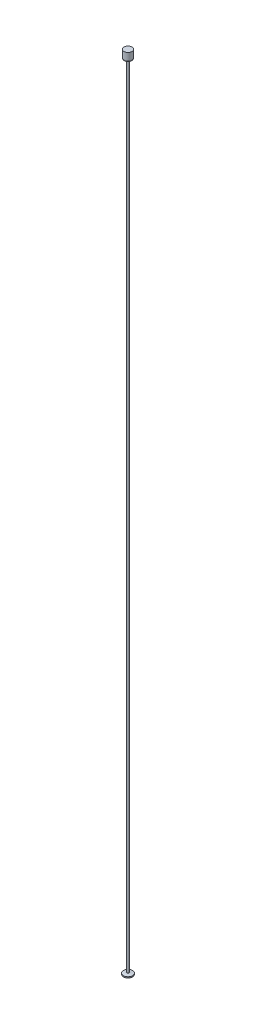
from build123d import *

# Parameters (mm, degrees)
SZKIC1_R                    = 6.9
DODANIE_WYCI_GNI_CIE1_DEPTH = 2.5
SFAZOWANIE1_SIZE            = 5
SFAZOWANIE1_SIZE2           = 0.881634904
SZKIC2_R                    = 1.5
DODANIE_WYCI_GNI_CIE2_DEPTH = 1200
DODANIE_WYCI_GNI_CIE3_START = -1
SZKIC3_R                    = 6
DODANIE_WYCI_GNI_CIE3_DEPTH = 13
ZAOKR_GLENIE1_R             = 2


with BuildPart() as part:
    # Szkic1 → Dodanie-wyci_gni_cie1 (new body)
    with BuildSketch(Plane(origin=(0, 0, 0), x_dir=(1, 0, 0), z_dir=(0, 1, 0))):
        with Locations(Location((0, 0, 0), (0, 0, 270))):
            Circle(SZKIC1_R)
    extrude(amount=DODANIE_WYCI_GNI_CIE1_DEPTH)

    # Sfazowanie1
    sfazowanie1_edges = [part.edges().sort_by_distance(p)[0] for p in [
        (0, 2.5, -6.9),
    ]]
    sfazowanie1_side = [part.faces().sort_by_distance(p)[0] for p in [
        (0, 2.5, 0),
    ]]
    chamfer(sfazowanie1_edges, length=SFAZOWANIE1_SIZE, length2=SFAZOWANIE1_SIZE2, reference=sfazowanie1_side[0])

    # Szkic2 → Dodanie-wyci_gni_cie2 (add)
    with BuildSketch(Plane(origin=(0, 2.5, 0), x_dir=(1, 0, 0), z_dir=(0, 1, 0))):
        with Locations(Location((0, 0, 0), (0, 0, 270))):
            Circle(SZKIC2_R)
    extrude(amount=DODANIE_WYCI_GNI_CIE2_DEPTH)


with BuildPart() as body_2:
    # Szkic3 → Dodanie-wyci_gni_cie3 (new body)
    with BuildSketch(Plane(origin=(0, 1202.5, 0), x_dir=(1, 0, 0), z_dir=(0, 1, 0)).offset(DODANIE_WYCI_GNI_CIE3_START)):
        with Locations(Location((0, 0, 0), (0, 0, 90))):
            Circle(SZKIC3_R)
    extrude(amount=DODANIE_WYCI_GNI_CIE3_DEPTH)

    # Zaokr_glenie1
    zaokr_glenie1_edges = [body_2.edges().sort_by_distance(p)[0] for p in [
        (0, 1201.5, 6),
    ]]
    fillet(zaokr_glenie1_edges, radius=ZAOKR_GLENIE1_R)


solid = Compound([part.part, body_2.part])
